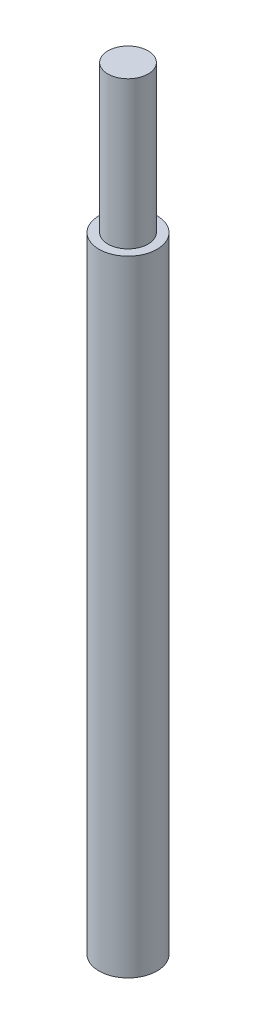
ISO-10303-21;
HEADER;
FILE_DESCRIPTION(('STEP AP214'),'2;1');
FILE_NAME('part.step','',(''),(''),'','','');
FILE_SCHEMA(('AUTOMOTIVE_DESIGN { 1 0 10303 214 1 1 1 1 }'));
ENDSEC;
DATA;
#1=APPLICATION_CONTEXT('core data for automotive mechanical design processes');
#2=APPLICATION_PROTOCOL_DEFINITION('international standard','automotive_design',2000,#1);
#3=PRODUCT_CONTEXT('',#1,'mechanical');
#4=PRODUCT('Part','Part','',(#3));
#5=PRODUCT_RELATED_PRODUCT_CATEGORY('part','',(#4));
#6=PRODUCT_DEFINITION_FORMATION('','',#4);
#7=PRODUCT_DEFINITION_CONTEXT('part definition',#1,'design');
#8=PRODUCT_DEFINITION('design','',#6,#7);
#9=PRODUCT_DEFINITION_SHAPE('','',#8);
#10=(LENGTH_UNIT() NAMED_UNIT(*) SI_UNIT(.MILLI.,.METRE.));
#11=(NAMED_UNIT(*) PLANE_ANGLE_UNIT() SI_UNIT($,.RADIAN.));
#12=(NAMED_UNIT(*) SI_UNIT($,.STERADIAN.) SOLID_ANGLE_UNIT());
#13=UNCERTAINTY_MEASURE_WITH_UNIT(LENGTH_MEASURE(1.E-05),#10,'distance_accuracy_value','');
#14=(GEOMETRIC_REPRESENTATION_CONTEXT(3) GLOBAL_UNCERTAINTY_ASSIGNED_CONTEXT((#13)) GLOBAL_UNIT_ASSIGNED_CONTEXT((#10,
#11,#12)) REPRESENTATION_CONTEXT('',''));
#15=CARTESIAN_POINT('',(0.,0.,0.));
#16=DIRECTION('',(0.,0.,1.));
#17=DIRECTION('',(1.,0.,0.));
#18=AXIS2_PLACEMENT_3D('',#15,#16,#17);
#19=CARTESIAN_POINT('',(0.,21.176453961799,0.));
#20=DIRECTION('',(0.,1.,0.));
#21=DIRECTION('',(0.,0.,1.));
#22=AXIS2_PLACEMENT_3D('',#19,#20,#21);
#23=PLANE('',#22);
#24=CARTESIAN_POINT('',(0.,21.176453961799,0.));
#25=DIRECTION('',(0.,-1.,0.));
#26=DIRECTION('',(0.,0.,-1.));
#27=AXIS2_PLACEMENT_3D('',#24,#25,#26);
#28=CIRCLE('',#27,1.143);
#29=CARTESIAN_POINT('',(0.,21.176453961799,-1.143));
#30=VERTEX_POINT('',#29);
#31=EDGE_CURVE('E10',#30,#30,#28,.T.);
#32=ORIENTED_EDGE('',*,*,#31,.F.);
#33=EDGE_LOOP('',(#32));
#34=FACE_BOUND('',#33,.T.);
#35=ADVANCED_FACE('F29',(#34),#23,.T.);
#36=CARTESIAN_POINT('',(0.,-22.765546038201,0.));
#37=DIRECTION('',(0.,-1.,0.));
#38=DIRECTION('',(0.,0.,-1.));
#39=AXIS2_PLACEMENT_3D('',#36,#37,#38);
#40=CYLINDRICAL_SURFACE('',#39,1.143);
#41=ORIENTED_EDGE('',*,*,#31,.T.);
#42=EDGE_LOOP('',(#41));
#43=FACE_BOUND('',#42,.T.);
#44=CARTESIAN_POINT('',(0.,12.794453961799,0.));
#45=DIRECTION('',(0.,-1.,0.));
#46=DIRECTION('',(0.,0.,-1.));
#47=AXIS2_PLACEMENT_3D('',#44,#45,#46);
#48=CIRCLE('',#47,1.143);
#49=CARTESIAN_POINT('',(0.,12.794453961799,-1.143));
#50=VERTEX_POINT('',#49);
#51=EDGE_CURVE('E35',#50,#50,#48,.T.);
#52=ORIENTED_EDGE('',*,*,#51,.F.);
#53=EDGE_LOOP('',(#52));
#54=FACE_BOUND('',#53,.T.);
#55=ADVANCED_FACE('F61',(#43,#54),#40,.T.);
#56=CARTESIAN_POINT('',(1.143,12.794453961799,0.));
#57=DIRECTION('',(0.,1.,0.));
#58=DIRECTION('',(0.,0.,1.));
#59=AXIS2_PLACEMENT_3D('',#56,#57,#58);
#60=PLANE('',#59);
#61=ORIENTED_EDGE('',*,*,#51,.T.);
#62=EDGE_LOOP('',(#61));
#63=FACE_BOUND('',#62,.T.);
#64=CARTESIAN_POINT('',(0.,12.794453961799,0.));
#65=DIRECTION('',(0.,-1.,0.));
#66=DIRECTION('',(0.,0.,-1.));
#67=AXIS2_PLACEMENT_3D('',#64,#65,#66);
#68=CIRCLE('',#67,1.651);
#69=CARTESIAN_POINT('',(0.,12.794453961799,-1.651));
#70=VERTEX_POINT('',#69);
#71=EDGE_CURVE('E39',#70,#70,#68,.T.);
#72=ORIENTED_EDGE('',*,*,#71,.F.);
#73=EDGE_LOOP('',(#72));
#74=FACE_BOUND('',#73,.T.);
#75=ADVANCED_FACE('F53',(#63,#74),#60,.T.);
#76=CARTESIAN_POINT('',(0.,-22.765546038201,0.));
#77=DIRECTION('',(0.,-1.,0.));
#78=DIRECTION('',(0.,0.,-1.));
#79=AXIS2_PLACEMENT_3D('',#76,#77,#78);
#80=CYLINDRICAL_SURFACE('',#79,1.651);
#81=ORIENTED_EDGE('',*,*,#71,.T.);
#82=EDGE_LOOP('',(#81));
#83=FACE_BOUND('',#82,.T.);
#84=CARTESIAN_POINT('',(0.,-22.765546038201,0.));
#85=DIRECTION('',(0.,-1.,0.));
#86=DIRECTION('',(0.,0.,-1.));
#87=AXIS2_PLACEMENT_3D('',#84,#85,#86);
#88=CIRCLE('',#87,1.651);
#89=CARTESIAN_POINT('',(0.,-22.765546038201,-1.651));
#90=VERTEX_POINT('',#89);
#91=EDGE_CURVE('E43',#90,#90,#88,.T.);
#92=ORIENTED_EDGE('',*,*,#91,.F.);
#93=EDGE_LOOP('',(#92));
#94=FACE_BOUND('',#93,.T.);
#95=ADVANCED_FACE('F51',(#83,#94),#80,.T.);
#96=CARTESIAN_POINT('',(0.,-22.765546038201,0.));
#97=DIRECTION('',(0.,-1.,0.));
#98=DIRECTION('',(0.,0.,-1.));
#99=AXIS2_PLACEMENT_3D('',#96,#97,#98);
#100=PLANE('',#99);
#101=ORIENTED_EDGE('',*,*,#91,.T.);
#102=EDGE_LOOP('',(#101));
#103=FACE_BOUND('',#102,.T.);
#104=ADVANCED_FACE('F49',(#103),#100,.T.);
#105=CLOSED_SHELL('',(#35,#55,#75,#95,#104));
#106=MANIFOLD_SOLID_BREP('B2',#105);
#107=ADVANCED_BREP_SHAPE_REPRESENTATION('',(#18,#106),#14);
#108=SHAPE_DEFINITION_REPRESENTATION(#9,#107);
ENDSEC;
END-ISO-10303-21;
